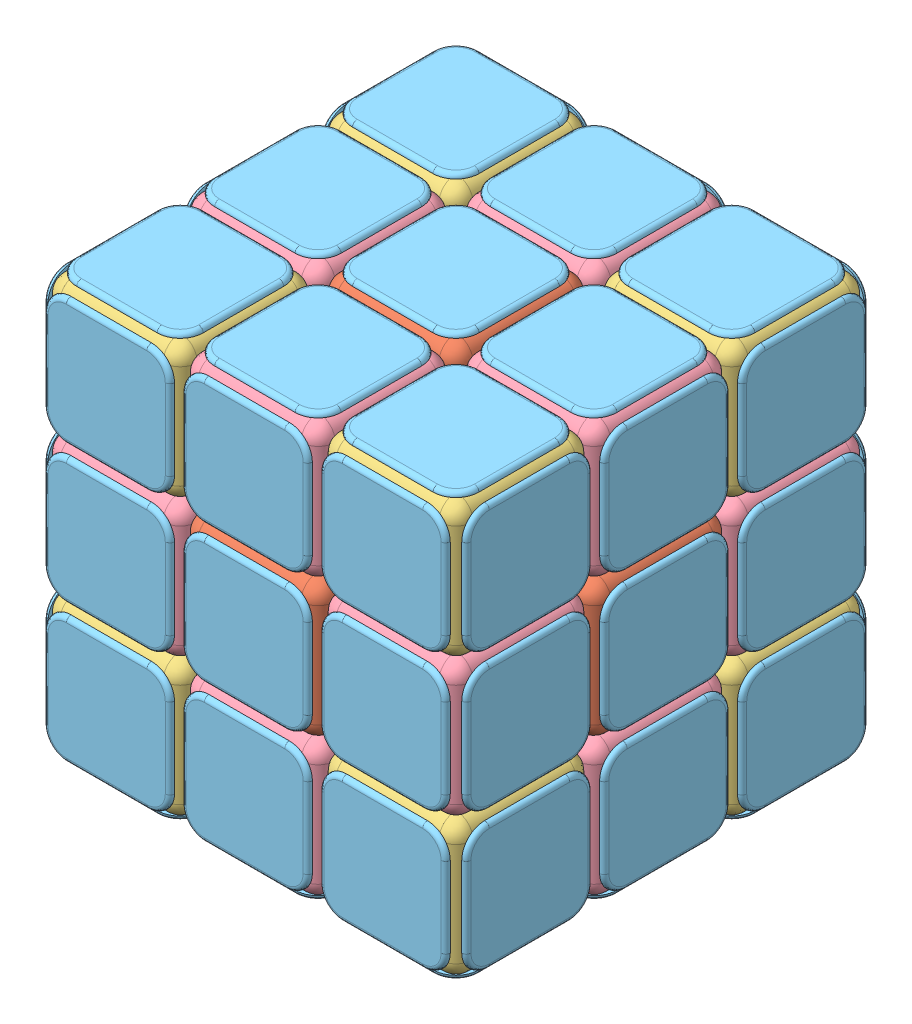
SolidWorks assembly Moving Rubik's Cube.SLDASM, configuration Default (file format 9000). Lengths in mm.
Overall size (92 92 92).
81 component instances, 5 part files, 325 mates.
Components (placement in the parent):
- Base-1: Base.SLDPRT [Default] at origin size (74.62 74.62 74.62)
- Centre Cap-1: Centre Cap.SLDPRT [Default] at (0 13.1631 0) x (1 0 0) z (0 -1 0) size (30 30 30)
- Corner-1: Corner.SLDPRT [Default] at (9.0013 9.0013 -9.1286) x (1 0 0) z (0 -1 0) size (37.5 37.5 37.5)
- Edge-1: Edge.SLDPRT [Default] at (0 9.823 -9.823) x (0 1 0) z (0 0 1) size (37.5 30 37.5)
- Corner-2: Corner.SLDPRT [Default] at (-9.1286 9.0013 -9.0014) x (0 0 -1) z (0 -1 0) size (37.5 37.5 37.5)
- Edge-2: Edge.SLDPRT [Default] at (-9.823 9.823 0) x (0 1 0) z (1 0 0) size (37.5 30 37.5)
- Corner-3: Corner.SLDPRT [Default] at (-9.0014 9.0013 9.1285) x (-1 0 0) z (0 -1 0) size (37.5 37.5 37.5)
- Edge-3: Edge.SLDPRT [Default] at (0 9.823 9.823) x (0 1 0) z (0 0 -1) size (37.5 30 37.5)
- Corner-4: Corner.SLDPRT [Default] at (9.1285 9.0013 9.0013) x (0 0 1) z (0 -1 0) size (37.5 37.5 37.5)
- Edge-4: Edge.SLDPRT [Default] at (9.823 9.823 0) x (0 1 0) z (-1 0 0) size (37.5 30 37.5)
- Edge-5: Edge.SLDPRT [Default] at (9.823 0 -9.823) x (0 0 -1) z (-1 0 0) size (37.5 30 37.5)
- Edge-6: Edge.SLDPRT [Default] at (-9.823 0 -9.823) x (-1 0 0) z (0 0 1) size (37.5 30 37.5)
- Edge-7: Edge.SLDPRT [Default] at (-9.823 0 9.823) x (0 0 1) z (1 0 0) size (37.5 30 37.5)
- Edge-8: Edge.SLDPRT [Default] at (9.823 0 9.823) x (1 0 0) z (0 0 -1) size (37.5 30 37.5)
- Centre Cap-2: Centre Cap.SLDPRT [Default] at (0 0 -13.1631) size (30 30 30)
- Centre Cap-3: Centre Cap.SLDPRT [Default] at (-13.1631 0 0) x (0 0 -1) z (1 0 0) size (30 30 30)
- Centre Cap-4: Centre Cap.SLDPRT [Default] at (0 0 13.1631) x (-1 0 0) z (0 0 -1) size (30 30 30)
- Centre Cap-5: Centre Cap.SLDPRT [Default] at (13.1631 0 0) x (0 0 1) z (-1 0 0) size (30 30 30)
- Corner-6: Corner.SLDPRT [Default] at (9.0013 -9.1286 -9.0014) size (37.5 37.5 37.5)
- Corner-7: Corner.SLDPRT [Default] at (-9.0014 -9.1286 -9.0014) x (0 0 -1) z (1 0 0) size (37.5 37.5 37.5)
- Corner-8: Corner.SLDPRT [Default] at (-9.0014 -9.1286 9.0013) x (-1 0 0) z (0 0 -1) size (37.5 37.5 37.5)
- Corner-9: Corner.SLDPRT [Default] at (9.0013 -9.1286 9.0013) x (0 0 1) z (-1 0 0) size (37.5 37.5 37.5)
- Edge-9: Edge.SLDPRT [Default] at (0 -9.823 -9.823) x (0 -1 0) z (0 0 1) size (37.5 30 37.5)
- Edge-10: Edge.SLDPRT [Default] at (-9.823 -9.823 0) x (0 -1 0) z (1 0 0) size (37.5 30 37.5)
- Edge-11: Edge.SLDPRT [Default] at (0 -9.823 9.823) x (0 -1 0) z (0 0 -1) size (37.5 30 37.5)
- Edge-12: Edge.SLDPRT [Default] at (9.823 -9.823 0) x (0 -1 0) z (-1 0 0) size (37.5 30 37.5)
- Centre Cap-6: Centre Cap.SLDPRT [Default] at (0 -13.1631 0) x (1 0 0) z (0 1 0) size (30 30 30)
- Sticker-1: Sticker.SLDPRT [Default] at (-30 30 45) size (27.5 27.5 1)
- Sticker-2: Sticker.SLDPRT [Default] at (0 30 45) size (27.5 27.5 1)
- Sticker-3: Sticker.SLDPRT [Default] at (30 30 45) size (27.5 27.5 1)
- Sticker-6: Sticker.SLDPRT [Default] at (-30 0 45) size (27.5 27.5 1)
- Sticker-7: Sticker.SLDPRT [Default] at (0 0 45) size (27.5 27.5 1)
- Sticker-8: Sticker.SLDPRT [Default] at (30 0 45) x (0 -1 0) z (0 0 1) size (27.5 27.5 1)
- Sticker-9: Sticker.SLDPRT [Default] at (-30 -30 45) size (27.5 27.5 1)
- Sticker-10: Sticker.SLDPRT [Default] at (0 -30 45) size (27.5 27.5 1)
- Sticker-11: Sticker.SLDPRT [Default] at (30 -30 45) size (27.5 27.5 1)
- Sticker-12: Sticker.SLDPRT [Default] at (45 30 30) x (0 0 -1) z (1 0 0) size (27.5 27.5 1)
- Sticker-13: Sticker.SLDPRT [Default] at (45 30 0) x (0 0 -1) z (1 0 0) size (27.5 27.5 1)
- Sticker-14: Sticker.SLDPRT [Default] at (45 30 -30) x (0 0 -1) z (1 0 0) size (27.5 27.5 1)
- Sticker-15: Sticker.SLDPRT [Default] at (45 0 30) x (0 0 -1) z (1 0 0) size (27.5 27.5 1)
- Sticker-16: Sticker.SLDPRT [Default] at (45 0 0) x (0 0 -1) z (1 0 0) size (27.5 27.5 1)
- Sticker-17: Sticker.SLDPRT [Default] at (45 0 -30) x (0 -1 0) z (1 0 0) size (27.5 27.5 1)
- Sticker-18: Sticker.SLDPRT [Default] at (45 -30 30) x (0 0 -1) z (1 0 0) size (27.5 27.5 1)
- Sticker-19: Sticker.SLDPRT [Default] at (45 -30 0) x (0 0 -1) z (1 0 0) size (27.5 27.5 1)
- Sticker-20: Sticker.SLDPRT [Default] at (45 -30 -30) x (0 0 -1) z (1 0 0) size (27.5 27.5 1)
- Sticker-21: Sticker.SLDPRT [Default] at (-30 45 -30) x (1 0 0) z (0 1 0) size (27.5 27.5 1)
- Sticker-22: Sticker.SLDPRT [Default] at (0 45 -30) x (1 0 0) z (0 1 0) size (27.5 27.5 1)
- Sticker-23: Sticker.SLDPRT [Default] at (30 45 -30) x (1 0 0) z (0 1 0) size (27.5 27.5 1)
- Sticker-24: Sticker.SLDPRT [Default] at (-30 45 0) x (1 0 0) z (0 1 0) size (27.5 27.5 1)
- Sticker-25: Sticker.SLDPRT [Default] at (0 45 0) x (1 0 0) z (0 1 0) size (27.5 27.5 1)
- Sticker-26: Sticker.SLDPRT [Default] at (30 45 0) x (1 0 0) z (0 1 0) size (27.5 27.5 1)
- Sticker-27: Sticker.SLDPRT [Default] at (-30 45 30) x (1 0 0) z (0 1 0) size (27.5 27.5 1)
- Sticker-28: Sticker.SLDPRT [Default] at (0 45 30) x (1 0 0) z (0 1 0) size (27.5 27.5 1)
- Sticker-29: Sticker.SLDPRT [Default] at (30 45 30) x (1 0 0) z (0 1 0) size (27.5 27.5 1)
- Sticker-30: Sticker.SLDPRT [Default] at (30 30 -45) x (-1 0 0) z (0 0 -1) size (27.5 27.5 1)
- Sticker-31: Sticker.SLDPRT [Default] at (0 30 -45) x (-1 0 0) z (0 0 -1) size (27.5 27.5 1)
- Sticker-32: Sticker.SLDPRT [Default] at (-30 30 -45) x (-1 0 0) z (0 0 -1) size (27.5 27.5 1)
- Sticker-33: Sticker.SLDPRT [Default] at (30 0 -45) x (-1 0 0) z (0 0 -1) size (27.5 27.5 1)
- Sticker-34: Sticker.SLDPRT [Default] at (0 0 -45) x (-1 0 0) z (0 0 -1) size (27.5 27.5 1)
- Sticker-35: Sticker.SLDPRT [Default] at (-30 0 -45) x (0 -1 0) z (0 0 -1) size (27.5 27.5 1)
- Sticker-36: Sticker.SLDPRT [Default] at (30 -30 -45) x (-1 0 0) z (0 0 -1) size (27.5 27.5 1)
- Sticker-37: Sticker.SLDPRT [Default] at (0 -30 -45) x (-1 0 0) z (0 0 -1) size (27.5 27.5 1)
- Sticker-38: Sticker.SLDPRT [Default] at (-30 -30 -45) x (-1 0 0) z (0 0 -1) size (27.5 27.5 1)
- Sticker-39: Sticker.SLDPRT [Default] at (-45 30 -30) x (0 0 1) z (-1 0 0) size (27.5 27.5 1)
- Sticker-40: Sticker.SLDPRT [Default] at (-45 30 0) x (0 0 1) z (-1 0 0) size (27.5 27.5 1)
- Sticker-41: Sticker.SLDPRT [Default] at (-45 30 30) x (0 0 1) z (-1 0 0) size (27.5 27.5 1)
- Sticker-42: Sticker.SLDPRT [Default] at (-45 0 -30) x (0 0 1) z (-1 0 0) size (27.5 27.5 1)
- Sticker-43: Sticker.SLDPRT [Default] at (-45 0 0) x (0 0 1) z (-1 0 0) size (27.5 27.5 1)
- Sticker-44: Sticker.SLDPRT [Default] at (-45 0 30) x (0 -1 0) z (-1 0 0) size (27.5 27.5 1)
- Sticker-45: Sticker.SLDPRT [Default] at (-45 -30 -30) x (0 0 1) z (-1 0 0) size (27.5 27.5 1)
- Sticker-46: Sticker.SLDPRT [Default] at (-45 -30 0) x (0 0 1) z (-1 0 0) size (27.5 27.5 1)
- Sticker-47: Sticker.SLDPRT [Default] at (-45 -30 30) x (0 0 1) z (-1 0 0) size (27.5 27.5 1)
- Sticker-48: Sticker.SLDPRT [Default] at (-30 -45 30) x (0 0 1) z (0 -1 0) size (27.5 27.5 1)
- Sticker-49: Sticker.SLDPRT [Default] at (0 -45 30) x (0 0 1) z (0 -1 0) size (27.5 27.5 1)
- Sticker-50: Sticker.SLDPRT [Default] at (30 -45 30) x (0 0 1) z (0 -1 0) size (27.5 27.5 1)
- Sticker-51: Sticker.SLDPRT [Default] at (-30 -45 0) x (0 0 1) z (0 -1 0) size (27.5 27.5 1)
- Sticker-52: Sticker.SLDPRT [Default] at (0 -45 0) x (0 0 1) z (0 -1 0) size (27.5 27.5 1)
- Sticker-53: Sticker.SLDPRT [Default] at (30 -45 0) x (0 0 1) z (0 -1 0) size (27.5 27.5 1)
- Sticker-54: Sticker.SLDPRT [Default] at (-30 -45 -30) x (0 0 1) z (0 -1 0) size (27.5 27.5 1)
- Sticker-55: Sticker.SLDPRT [Default] at (0 -45 -30) x (0 0 1) z (0 -1 0) size (27.5 27.5 1)
- Sticker-56: Sticker.SLDPRT [Default] at (30 -45 -30) x (0 0 1) z (0 -1 0) size (27.5 27.5 1)
Mates (geometry in assembly coordinates):
- Coincident1: coordinate: point of Base-1; point of assembly
- Tangent1: tangent aligned: sphere of Base-1; sphere of Centre Cap-1
- Tangent3: tangent aligned: sphere of Centre Cap-1; sphere of Corner-1
- Tangent4: tangent aligned: sphere of Centre Cap-1; sphere of Edge-1
- Tangent5: tangent aligned: sphere of Centre Cap-1; sphere of Corner-2
- Tangent6: tangent aligned: sphere of Centre Cap-1; sphere of Edge-2
- Tangent7: tangent aligned: sphere of Centre Cap-1; sphere of Corner-3
- Tangent8: tangent aligned: sphere of Centre Cap-1; sphere of Edge-3
- Tangent9: tangent aligned: sphere of Centre Cap-1; sphere of Corner-4
- Tangent10: tangent aligned: sphere of Centre Cap-1; sphere of Edge-4
- Bottom Coincident: concentric anti-aligned: cylinder of Base-1 through (0 37.5 0) axis (0 -1 0) radius 3.75; cylinder of Centre Cap-1 through (0 -375000 0) axis (0 1 0) radius 3.75
- Coincident2: coincident aligned: plane of Centre Cap-1 through (0 -45 0) normal (0 -1 0); plane of Corner-1 through (0 -45 0) normal (0 -1 0)
- Coincident4: coincident aligned: plane of Centre Cap-1 through (0 -45 0) normal (0 -1 0); plane of Edge-1 through (45 -45 45) normal (0 -1 0)
- Coincident6: coincident aligned: plane of Centre Cap-1 through (0 -45 0) normal (0 -1 0); plane of Corner-2 through (0 -45 0) normal (0 -1 0)
- Coincident8: coincident aligned: plane of Centre Cap-1 through (0 -45 0) normal (0 -1 0); plane of Edge-2 through (45 -45 -45) normal (0 -1 0)
- Coincident10: coincident aligned: plane of Centre Cap-1 through (0 -45 0) normal (0 -1 0); plane of Corner-3 through (0 -45 0) normal (0 -1 0)
- Coincident12: coincident aligned: plane of Centre Cap-1 through (0 -45 0) normal (0 -1 0); plane of Edge-3 through (-45 -45 -45) normal (0 -1 0)
- Coincident14: coincident aligned: plane of Centre Cap-1 through (0 -45 0) normal (0 -1 0); plane of Corner-4 through (0 -45 0) normal (0 -1 0)
- Coincident16: coincident aligned: plane of Centre Cap-1 through (0 -45 0) normal (0 -1 0); plane of Edge-4 through (-45 -45 45) normal (0 -1 0)
- X: coincident anti-aligned: plane of Centre Cap-1 through (-15 45 0) normal (-1 0 0); plane of Corner-1 through (-15 45 0) normal (1 0 0)
- XX: coincident aligned: plane of Centre Cap-1 through (15 45 0) normal (1 0 0); plane of Edge-1 through (15 0 -45) normal (1 0 0)
- XXX: coincident anti-aligned: plane of Centre Cap-1 through (15 45 0) normal (1 0 0); plane of Corner-2 through (15 45 0) normal (-1 0 0)
- XXXX: coincident aligned: plane of Centre Cap-1 through (0 45 -15) normal (0 0 -1); plane of Edge-2 through (-45 0 -15) normal (0 0 -1)
- XXXXX: coincident anti-aligned: plane of Centre Cap-1 through (15 45 0) normal (1 0 0); plane of Corner-3 through (15 45 0) normal (-1 0 0)
- XXXXXX: coincident aligned: plane of Centre Cap-1 through (-15 45 0) normal (-1 0 0); plane of Edge-3 through (-15 0 45) normal (-1 0 0)
- XXXXXXX: coincident anti-aligned: plane of Centre Cap-1 through (0 45 -15) normal (0 0 -1); plane of Corner-4 through (0 45 -15) normal (0 0 1)
- XXXXXXXX: coincident aligned: plane of Centre Cap-1 through (0 45 15) normal (0 0 1); plane of Edge-4 through (45 0 15) normal (0 0 1)
- Coincident118: coincident anti-aligned: plane of Centre Cap-1 through (0 45 15) normal (0 0 1); plane of Edge-1 through (15 0 15) normal (0 0 -1)
- Coincident19: coincident aligned: plane of Corner-1 through (45 -45 45) normal (0 0 1); plane of Edge-5 through (-45 45 45) normal (0 0 1)
- Coincident20: coincident aligned: plane of Corner-1 through (-45 -45 -45) normal (-1 0 0); plane of Edge-5 through (-45 0 0) normal (-1 0 0)
- Coincident22: coincident aligned: plane of Corner-2 through (-45 -45 45) normal (0 0 1); plane of Edge-6 through (0 0 45) normal (0 0 1)
- Coincident23: coincident aligned: plane of Corner-2 through (45 -45 -45) normal (1 0 0); plane of Edge-6 through (45 45 45) normal (1 0 0)
- Coincident25: coincident aligned: plane of Corner-3 through (45 -45 45) normal (1 0 0); plane of Edge-7 through (45 0 0) normal (1 0 0)
- Coincident26: coincident aligned: plane of Edge-3 through (0 0 -45) normal (0 0 -1); plane of Edge-7 through (45 45 -45) normal (0 0 -1)
- Coincident28: coincident aligned: plane of Corner-4 through (-45 -45 45) normal (-1 0 0); plane of Edge-8 through (-45 45 -45) normal (-1 0 0)
- Coincident29: coincident aligned: plane of Corner-4 through (45 -45 -45) normal (0 0 -1); plane of Edge-8 through (0 0 -45) normal (0 0 -1)
- Top Concentric: concentric aligned: cylinder of Base-1 through (0 37.5 0) axis (0 -1 0) radius 3.75; cylinder of Centre Cap-6 through (0 375000 0) axis (0 -1 0) radius 3.75
- Coincident119: coincident aligned: plane of Corner-9 through (-45 45 45) normal (0 1 0); plane of Edge-12 through (-45 45 -45) normal (0 1 0)
- Coincident121: coincident aligned: plane of Corner-9 through (-45 45 45) normal (0 1 0); plane of Corner-6 through (45 45 45) normal (0 1 0)
- Coincident122: coincident aligned: plane of Corner-9 through (-45 45 45) normal (0 1 0); plane of Edge-11 through (45 45 -45) normal (0 1 0)
- Coincident123: coincident aligned: plane of Corner-9 through (-45 45 45) normal (0 1 0); plane of Centre Cap-6 through (0 45 0) normal (0 1 0)
- Coincident124: coincident aligned: plane of Corner-9 through (-45 45 45) normal (0 1 0); plane of Edge-9 through (-45 45 45) normal (0 1 0)
- Coincident125: coincident aligned: plane of Corner-9 through (-45 45 45) normal (0 1 0); plane of Corner-8 through (-45 45 -45) normal (0 1 0)
- Coincident126: coincident aligned: plane of Corner-9 through (-45 45 45) normal (0 1 0); plane of Edge-10 through (45 45 45) normal (0 1 0)
- Coincident127: coincident aligned: plane of Corner-9 through (-45 45 45) normal (0 1 0); plane of Corner-7 through (45 45 -45) normal (0 1 0)
- Coincident128: coincident anti-aligned: plane of Edge-9 through (-15 0 15) normal (0 0 -1); plane of Centre Cap-6 through (0 -45 15) normal (0 0 1)
- Coincident137: coincident anti-aligned: plane of Corner-6 through (-15 0 -45) normal (1 0 0); plane of Centre Cap-6 through (-15 -45 0) normal (-1 0 0)
- Coincident138: coincident aligned: plane of Edge-9 through (-15 0 -45) normal (-1 0 0); plane of Centre Cap-6 through (-15 -45 0) normal (-1 0 0)
- Coincident139: coincident anti-aligned: plane of Corner-7 through (15 15 0) normal (-1 0 0); plane of Centre Cap-6 through (15 -45 0) normal (1 0 0)
- Coincident140: coincident aligned: plane of Edge-10 through (-45 0 15) normal (0 0 1); plane of Centre Cap-6 through (0 -45 15) normal (0 0 1)
- Coincident141: coincident anti-aligned: plane of Corner-8 through (0 15 -15) normal (0 0 1); plane of Centre Cap-6 through (0 -45 -15) normal (0 0 -1)
- Coincident143: coincident aligned: plane of Edge-11 through (15 0 45) normal (1 0 0); plane of Centre Cap-6 through (15 -45 0) normal (1 0 0)
- Coincident144: coincident anti-aligned: plane of Corner-9 through (-15 15 0) normal (1 0 0); plane of Centre Cap-6 through (-15 -45 0) normal (-1 0 0)
- Coincident145: coincident aligned: plane of Edge-12 through (45 0 -15) normal (0 0 -1); plane of Centre Cap-6 through (0 -45 -15) normal (0 0 -1)
- Coincident30: coincident aligned: plane of Edge-5 through (-45 45 45) normal (0 0 1); plane of Corner-6 through (0 0 45) normal (0 0 1)
- Coincident31: coincident aligned: plane of Edge-5 through (-45 0 0) normal (-1 0 0); plane of Corner-6 through (-45 -45 45) normal (-1 0 0)
- Coincident32: coincident aligned: plane of Edge-6 through (0 0 45) normal (0 0 1); plane of Corner-7 through (45 -45 45) normal (0 0 1)
- Coincident33: coincident aligned: plane of Edge-6 through (45 45 45) normal (1 0 0); plane of Corner-7 through (45 0 0) normal (1 0 0)
- Coincident34: coincident aligned: plane of Edge-7 through (45 45 -45) normal (0 0 -1); plane of Corner-8 through (0 0 -45) normal (0 0 -1)
- Coincident35: coincident aligned: plane of Edge-7 through (45 0 0) normal (1 0 0); plane of Corner-8 through (45 -45 -45) normal (1 0 0)
- Coincident36: coincident aligned: plane of Edge-8 through (0 0 -45) normal (0 0 -1); plane of Corner-9 through (-45 -45 -45) normal (0 0 -1)
- Coincident37: coincident aligned: plane of Edge-8 through (-45 45 -45) normal (-1 0 0); plane of Corner-9 through (-45 0 0) normal (-1 0 0)
- Coincident38: coincident aligned: plane of Centre Cap-2 through (0 0 45) normal (0 0 1); plane of Edge-9 through (0 0 45) normal (0 0 1)
- Coincident40: coincident aligned: plane of Centre Cap-3 through (45 0 0) normal (1 0 0); plane of Edge-10 through (45 0 0) normal (1 0 0)
- Coincident42: coincident aligned: plane of Centre Cap-4 through (0 0 -45) normal (0 0 -1); plane of Edge-11 through (0 0 -45) normal (0 0 -1)
- Coincident44: coincident aligned: plane of Centre Cap-5 through (-45 0 0) normal (-1 0 0); plane of Edge-12 through (-45 0 0) normal (-1 0 0)
- Front Concentric: concentric aligned: cylinder of Base-1 through (0 0 37.5) axis (0 0 -1) radius 3.75; cylinder of Centre Cap-2 through (0 0 375000) axis (0 0 -1) radius 3.75
- Coincident146: coincident aligned: plane of Corner-6 through (0 0 45) normal (0 0 1); plane of Edge-9 through (0 0 45) normal (0 0 1)
- Coincident147: coincident aligned: plane of Corner-6 through (0 0 45) normal (0 0 1); plane of Corner-7 through (45 -45 45) normal (0 0 1)
- Coincident148: coincident aligned: plane of Corner-6 through (0 0 45) normal (0 0 1); plane of Edge-6 through (0 0 45) normal (0 0 1)
- Coincident149: coincident aligned: plane of Corner-6 through (0 0 45) normal (0 0 1); plane of Centre Cap-2 through (0 0 45) normal (0 0 1)
- Coincident150: coincident aligned: plane of Corner-6 through (0 0 45) normal (0 0 1); plane of Edge-5 through (-45 45 45) normal (0 0 1)
- Coincident151: coincident aligned: plane of Corner-6 through (0 0 45) normal (0 0 1); plane of Corner-1 through (45 -45 45) normal (0 0 1)
- Coincident152: coincident aligned: plane of Corner-6 through (0 0 45) normal (0 0 1); plane of Edge-1 through (0 0 45) normal (0 0 1)
- Coincident153: coincident aligned: plane of Corner-6 through (0 0 45) normal (0 0 1); plane of Corner-2 through (-45 -45 45) normal (0 0 1)
- Coincident154: coincident anti-aligned: plane of Centre Cap-2 through (0 15 -45) normal (0 1 0); plane of Edge-9 through (0 15 -45) normal (0 -1 0)
- Coincident155: coincident anti-aligned: plane of Centre Cap-2 through (-15 0 -45) normal (-1 0 0); plane of Corner-6 through (-15 0 -45) normal (1 0 0)
- Coincident156: coincident aligned: plane of Centre Cap-2 through (-15 0 -45) normal (-1 0 0); plane of Edge-9 through (-15 0 -45) normal (-1 0 0)
- Coincident157: coincident anti-aligned: plane of Centre Cap-2 through (15 0 -45) normal (1 0 0); plane of Corner-7 through (15 15 0) normal (-1 0 0)
- Coincident158: coincident aligned: plane of Edge-6 through (0 15 -45) normal (0 1 0); plane of Centre Cap-2 through (0 15 -45) normal (0 1 0)
- Coincident161: coincident anti-aligned: plane of Corner-2 through (15 -15 0) normal (0 1 0); plane of Centre Cap-2 through (0 -15 -45) normal (0 -1 0)
- Coincident159: coincident aligned: plane of Edge-1 through (15 0 -45) normal (1 0 0); plane of Centre Cap-2 through (15 0 -45) normal (1 0 0)
- Coincident160: coincident aligned: plane of Edge-1 through (-15 0 -45) normal (-1 0 0); plane of Centre Cap-2 through (-15 0 -45) normal (-1 0 0)
- Coincident162: coincident aligned: plane of Edge-5 through (45 -15 0) normal (0 -1 0); plane of Centre Cap-2 through (0 -15 -45) normal (0 -1 0)
- Coincident163: coincident aligned: plane of Edge-5 through (45 15 0) normal (0 1 0); plane of Centre Cap-2 through (0 15 -45) normal (0 1 0)
- Back Concentric: concentric anti-aligned: cylinder of Base-1 through (0 0 37.5) axis (0 0 -1) radius 3.75; cylinder of Centre Cap-4 through (0 0 -375000) axis (0 0 1) radius 3.75
- Coincident164: coincident aligned: plane of Corner-9 through (-45 -45 -45) normal (0 0 -1); plane of Edge-11 through (0 0 -45) normal (0 0 -1)
- Coincident165: coincident aligned: plane of Corner-9 through (-45 -45 -45) normal (0 0 -1); plane of Corner-8 through (0 0 -45) normal (0 0 -1)
- Coincident166: coincident aligned: plane of Corner-9 through (-45 -45 -45) normal (0 0 -1); plane of Edge-7 through (45 45 -45) normal (0 0 -1)
- Coincident167: coincident aligned: plane of Corner-9 through (-45 -45 -45) normal (0 0 -1); plane of Centre Cap-4 through (0 0 -45) normal (0 0 -1)
- Coincident168: coincident aligned: plane of Corner-9 through (-45 -45 -45) normal (0 0 -1); plane of Edge-8 through (0 0 -45) normal (0 0 -1)
- Coincident169: coincident aligned: plane of Corner-9 through (-45 -45 -45) normal (0 0 -1); plane of Corner-4 through (45 -45 -45) normal (0 0 -1)
- Coincident170: coincident aligned: plane of Corner-9 through (-45 -45 -45) normal (0 0 -1); plane of Edge-3 through (0 0 -45) normal (0 0 -1)
- Coincident171: coincident aligned: plane of Corner-9 through (-45 -45 -45) normal (0 0 -1); plane of Corner-3 through (-45 -45 -45) normal (0 0 -1)
- Coincident172: coincident anti-aligned: plane of Centre Cap-4 through (15 0 45) normal (1 0 0); plane of Corner-8 through (15 0 45) normal (-1 0 0)
- Coincident173: coincident aligned: plane of Centre Cap-4 through (15 0 45) normal (1 0 0); plane of Edge-11 through (15 0 45) normal (1 0 0)
- Coincident174: coincident anti-aligned: plane of Centre Cap-4 through (-15 0 45) normal (-1 0 0); plane of Corner-9 through (-15 15 0) normal (1 0 0)
- Coincident175: coincident aligned: plane of Edge-8 through (0 15 45) normal (0 1 0); plane of Centre Cap-4 through (0 15 45) normal (0 1 0)
- Coincident176: coincident anti-aligned: plane of Corner-4 through (-15 -15 0) normal (0 1 0); plane of Centre Cap-4 through (0 -15 45) normal (0 -1 0)
- Coincident182: coincident aligned: plane of Edge-3 through (-15 0 45) normal (-1 0 0); plane of Centre Cap-4 through (-15 0 45) normal (-1 0 0)
- Coincident178: coincident anti-aligned: plane of Corner-3 through (15 45 0) normal (-1 0 0); plane of Centre Cap-4 through (15 0 45) normal (1 0 0)
- Coincident179: coincident aligned: plane of Edge-7 through (-45 -15 0) normal (0 -1 0); plane of Centre Cap-4 through (0 -15 45) normal (0 -1 0)
- Coincident180: coincident aligned: plane of Edge-7 through (-45 15 0) normal (0 1 0); plane of Centre Cap-4 through (0 15 45) normal (0 1 0)
- Coincident181: coincident anti-aligned: plane of Centre Cap-4 through (0 15 45) normal (0 1 0); plane of Edge-11 through (0 15 45) normal (0 -1 0)
- Left Concentric: concentric aligned: cylinder of Base-1 through (37.5 0 0) axis (-1 0 0) radius 3.75; cylinder of Centre Cap-3 through (375000 0 0) axis (-1 0 0) radius 3.75
- Coincident191: coincident aligned: plane of Corner-7 through (45 0 0) normal (1 0 0); plane of Edge-10 through (45 0 0) normal (1 0 0)
- Coincident192: coincident aligned: plane of Corner-7 through (45 0 0) normal (1 0 0); plane of Corner-8 through (45 -45 -45) normal (1 0 0)
- Coincident193: coincident aligned: plane of Corner-7 through (45 0 0) normal (1 0 0); plane of Edge-6 through (45 45 45) normal (1 0 0)
- Coincident194: coincident aligned: plane of Corner-7 through (45 0 0) normal (1 0 0); plane of Centre Cap-3 through (45 0 0) normal (1 0 0)
- Coincident195: coincident aligned: plane of Corner-7 through (45 0 0) normal (1 0 0); plane of Edge-7 through (45 0 0) normal (1 0 0)
- Coincident196: coincident aligned: plane of Corner-7 through (45 0 0) normal (1 0 0); plane of Corner-2 through (45 -45 -45) normal (1 0 0)
- Coincident197: coincident aligned: plane of Corner-7 through (45 0 0) normal (1 0 0); plane of Edge-2 through (45 0 0) normal (1 0 0)
- Coincident198: coincident aligned: plane of Corner-7 through (45 0 0) normal (1 0 0); plane of Corner-3 through (45 -45 45) normal (1 0 0)
- Coincident200: coincident anti-aligned: plane of Centre Cap-3 through (-45 0 15) normal (0 0 1); plane of Corner-7 through (-45 0 15) normal (0 0 -1)
- Coincident201: coincident aligned: plane of Centre Cap-3 through (-45 0 15) normal (0 0 1); plane of Edge-10 through (-45 0 15) normal (0 0 1)
- Coincident202: coincident anti-aligned: plane of Centre Cap-3 through (-45 0 -15) normal (0 0 -1); plane of Corner-8 through (0 15 -15) normal (0 0 1)
- Coincident203: coincident aligned: plane of Edge-7 through (-45 15 0) normal (0 1 0); plane of Centre Cap-3 through (-45 15 0) normal (0 1 0)
- Coincident209: coincident aligned: plane of Edge-7 through (-45 -15 0) normal (0 -1 0); plane of Centre Cap-3 through (-45 -15 0) normal (0 -1 0)
- Coincident204: coincident anti-aligned: plane of Corner-3 through (0 45 -15) normal (0 0 1); plane of Centre Cap-3 through (-45 0 -15) normal (0 0 -1)
- Coincident205: coincident aligned: plane of Edge-2 through (-45 0 15) normal (0 0 1); plane of Centre Cap-3 through (-45 0 15) normal (0 0 1)
- Coincident206: coincident anti-aligned: plane of Corner-2 through (15 -15 0) normal (0 1 0); plane of Centre Cap-3 through (-45 -15 0) normal (0 -1 0)
- Coincident207: coincident aligned: plane of Edge-6 through (0 15 -45) normal (0 1 0); plane of Centre Cap-3 through (-45 15 0) normal (0 1 0)
- Coincident208: coincident anti-aligned: plane of Centre Cap-3 through (-45 15 0) normal (0 1 0); plane of Edge-10 through (-45 15 0) normal (0 -1 0)
- Right Concentric: concentric anti-aligned: cylinder of Base-1 through (37.5 0 0) axis (-1 0 0) radius 3.75; cylinder of Centre Cap-5 through (-375000 0 0) axis (1 0 0) radius 3.75
- Coincident210: coincident aligned: plane of Corner-9 through (-45 0 0) normal (-1 0 0); plane of Edge-12 through (-45 0 0) normal (-1 0 0)
- Coincident211: coincident aligned: plane of Corner-9 through (-45 0 0) normal (-1 0 0); plane of Corner-6 through (-45 -45 45) normal (-1 0 0)
- Coincident213: coincident aligned: plane of Corner-9 through (-45 0 0) normal (-1 0 0); plane of Edge-8 through (-45 45 -45) normal (-1 0 0)
- Coincident214: coincident aligned: plane of Corner-9 through (-45 0 0) normal (-1 0 0); plane of Centre Cap-5 through (-45 0 0) normal (-1 0 0)
- Coincident215: coincident aligned: plane of Corner-9 through (-45 0 0) normal (-1 0 0); plane of Edge-5 through (-45 0 0) normal (-1 0 0)
- Coincident216: coincident aligned: plane of Corner-9 through (-45 0 0) normal (-1 0 0); plane of Corner-4 through (-45 -45 45) normal (-1 0 0)
- Coincident217: coincident aligned: plane of Corner-9 through (-45 0 0) normal (-1 0 0); plane of Edge-4 through (-45 0 0) normal (-1 0 0)
- Coincident218: coincident aligned: plane of Corner-9 through (-45 0 0) normal (-1 0 0); plane of Corner-1 through (-45 -45 -45) normal (-1 0 0)
- Coincident219: coincident anti-aligned: plane of Centre Cap-5 through (45 0 -15) normal (0 0 -1); plane of Corner-9 through (45 0 -15) normal (0 0 1)
- Coincident220: coincident aligned: plane of Centre Cap-5 through (45 0 -15) normal (0 0 -1); plane of Edge-12 through (45 0 -15) normal (0 0 -1)
- Coincident221: coincident anti-aligned: plane of Centre Cap-5 through (45 0 15) normal (0 0 1); plane of Corner-6 through (0 15 15) normal (0 0 -1)
- Coincident222: coincident aligned: plane of Edge-5 through (45 15 0) normal (0 1 0); plane of Centre Cap-5 through (45 15 0) normal (0 1 0)
- Coincident223: coincident anti-aligned: plane of Corner-1 through (0 -15 15) normal (0 1 0); plane of Centre Cap-5 through (45 -15 0) normal (0 -1 0)
- Coincident224: coincident aligned: plane of Edge-4 through (45 0 15) normal (0 0 1); plane of Centre Cap-5 through (45 0 15) normal (0 0 1)
- Coincident228: coincident aligned: plane of Edge-4 through (45 0 -15) normal (0 0 -1); plane of Centre Cap-5 through (45 0 -15) normal (0 0 -1)
- Coincident225: coincident anti-aligned: plane of Corner-4 through (-15 -15 0) normal (0 1 0); plane of Centre Cap-5 through (45 -15 0) normal (0 -1 0)
- Coincident226: coincident aligned: plane of Edge-8 through (0 15 45) normal (0 1 0); plane of Centre Cap-5 through (45 15 0) normal (0 1 0)
- Coincident227: coincident anti-aligned: plane of Centre Cap-5 through (45 15 0) normal (0 1 0); plane of Edge-12 through (45 15 0) normal (0 -1 0)
- Coincident18: coincident anti-aligned: plane of Corner-1 through (-36.7424 -7.5 -37.5) normal (0 1 0); plane of Edge-5 through (-35.9688 -7.5 55.2609) normal (0 -1 0)
- Coincident21: coincident anti-aligned: plane of Corner-2 through (-37.5 -7.5 36.7423) normal (0 1 0); plane of Edge-6 through (55.2609 -7.5 35.9687) normal (0 -1 0)
- Coincident24: coincident anti-aligned: plane of Corner-3 through (36.7423 -7.5 37.5) normal (0 1 0); plane of Edge-7 through (35.9687 -7.5 -55.2609) normal (0 -1 0)
- Coincident27: coincident anti-aligned: plane of Corner-4 through (37.5 -7.5 -36.7424) normal (0 1 0); plane of Edge-8 through (-55.2609 -7.5 -35.9688) normal (0 -1 0)
- Tangent11: tangent aligned: sphere of Base-1; sphere of Centre Cap-2
- Tangent12: tangent aligned: sphere of Base-1; sphere of Centre Cap-3
- Tangent13: tangent aligned: sphere of Base-1; sphere of Centre Cap-4
- Tangent14: tangent aligned: sphere of Base-1; sphere of Centre Cap-5
- Tangent15: tangent aligned: sphere of Edge-5; sphere of Corner-6
- Tangent16: tangent aligned: sphere of Edge-6; sphere of Corner-7
- Tangent17: tangent aligned: sphere of Edge-7; sphere of Corner-8
- Tangent18: tangent aligned: sphere of Edge-8; sphere of Corner-9
- Tangent19: tangent aligned: sphere of Centre Cap-2; sphere of Edge-9
- Coincident39: coincident anti-aligned: plane of Corner-7 through (7.5 -37.5 36.7423) normal (-1 0 0); plane of Edge-9 through (7.5 55.2609 35.9687) normal (1 0 0)
- Tangent20: tangent aligned: sphere of Centre Cap-3; sphere of Edge-10
- Coincident41: coincident anti-aligned: plane of Corner-8 through (36.7423 -37.5 -7.5) normal (0 0 1); plane of Edge-10 through (35.9687 55.2609 -7.5) normal (0 0 -1)
- Tangent21: tangent aligned: sphere of Centre Cap-4; sphere of Edge-11
- Coincident43: coincident anti-aligned: plane of Corner-9 through (-7.5 -37.5 -36.7424) normal (1 0 0); plane of Edge-11 through (-7.5 55.2609 -35.9688) normal (-1 0 0)
- Tangent22: tangent aligned: sphere of Centre Cap-5; sphere of Edge-12
- Coincident45: coincident anti-aligned: plane of Corner-6 through (-36.7424 -37.5 7.5) normal (0 0 -1); plane of Edge-12 through (-35.9688 55.2609 7.5) normal (0 0 1)
- Tangent23: tangent aligned: sphere of Base-1; sphere of Centre Cap-6
- Coincident46: coincident anti-aligned: plane of Corner-6 through (0 0 45) normal (0 0 1); plane of Sticker-1 through (-38.75 21.25 45) normal (0 0 -1)
- Coincident47: coincident anti-aligned: plane of Sticker-2 through (-8.75 21.25 45) normal (0 0 -1); plane of Edge-9 through (0 0 45) normal (0 0 1)
- Coincident48: coincident anti-aligned: plane of Corner-7 through (45 -45 45) normal (0 0 1); plane of Sticker-3 through (21.25 21.25 45) normal (0 0 -1)
- Coincident51: coincident anti-aligned: plane of Edge-5 through (-45 45 45) normal (0 0 1); plane of Sticker-6 through (-38.75 -8.75 45) normal (0 0 -1)
- Coincident53: coincident anti-aligned: plane of Centre Cap-2 through (0 0 45) normal (0 0 1); plane of Sticker-7 through (-8.75 -8.75 45) normal (0 0 -1)
- Coincident55: coincident anti-aligned: plane of Edge-6 through (0 0 45) normal (0 0 1); plane of Sticker-8 through (21.25 8.75 45) normal (0 0 -1)
- Coincident57: coincident anti-aligned: plane of Corner-1 through (45 -45 45) normal (0 0 1); plane of Sticker-9 through (-38.75 -38.75 45) normal (0 0 -1)
- Coincident58: coincident anti-aligned: plane of Edge-1 through (0 0 45) normal (0 0 1); plane of Sticker-10 through (-8.75 -38.75 45) normal (0 0 -1)
- Coincident61: coincident anti-aligned: plane of Corner-2 through (-45 -45 45) normal (0 0 1); plane of Sticker-11 through (21.25 -38.75 45) normal (0 0 -1)
- Coincident62: coincident anti-aligned: plane of Corner-7 through (45 0 0) normal (1 0 0); plane of Sticker-12 through (45 21.25 38.75) normal (-1 0 0)
- Coincident63: coincident anti-aligned: plane of Edge-10 through (45 0 0) normal (1 0 0); plane of Sticker-13 through (45 21.25 8.75) normal (-1 0 0)
- Coincident65: coincident anti-aligned: plane of Corner-8 through (45 -45 -45) normal (1 0 0); plane of Sticker-14 through (45 21.25 -21.25) normal (-1 0 0)
- Coincident66: coincident anti-aligned: plane of Edge-6 through (45 45 45) normal (1 0 0); plane of Sticker-15 through (45 -8.75 38.75) normal (-1 0 0)
- Coincident68: coincident anti-aligned: plane of Centre Cap-3 through (45 0 0) normal (1 0 0); plane of Sticker-16 through (45 -8.75 8.75) normal (-1 0 0)
- Coincident69: coincident anti-aligned: plane of Edge-7 through (45 0 0) normal (1 0 0); plane of Sticker-17 through (45 8.75 -21.25) normal (-1 0 0)
- Coincident71: coincident anti-aligned: plane of Corner-2 through (45 -45 -45) normal (1 0 0); plane of Sticker-18 through (45 -38.75 38.75) normal (-1 0 0)
- Coincident72: coincident anti-aligned: plane of Edge-2 through (45 0 0) normal (1 0 0); plane of Sticker-19 through (45 -38.75 8.75) normal (-1 0 0)
- Coincident73: coincident anti-aligned: plane of Corner-3 through (45 -45 45) normal (1 0 0); plane of Sticker-20 through (45 -38.75 -21.25) normal (-1 0 0)
- Coincident74: coincident anti-aligned: plane of Corner-9 through (-45 45 45) normal (0 1 0); plane of Sticker-21 through (-38.75 45 -21.25) normal (0 -1 0)
- Coincident75: coincident anti-aligned: plane of Edge-11 through (45 45 -45) normal (0 1 0); plane of Sticker-22 through (-8.75 45 -21.25) normal (0 -1 0)
- Coincident76: coincident anti-aligned: plane of Corner-8 through (-45 45 -45) normal (0 1 0); plane of Sticker-23 through (21.25 45 -21.25) normal (0 -1 0)
- Coincident77: coincident anti-aligned: plane of Edge-12 through (-45 45 -45) normal (0 1 0); plane of Sticker-24 through (-38.75 45 8.75) normal (0 -1 0)
- Coincident79: coincident anti-aligned: plane of Centre Cap-6 through (0 45 0) normal (0 1 0); plane of Sticker-25 through (-8.75 45 8.75) normal (0 -1 0)
- Coincident80: coincident anti-aligned: plane of Edge-10 through (45 45 45) normal (0 1 0); plane of Sticker-26 through (21.25 45 8.75) normal (0 -1 0)
- Coincident82: coincident anti-aligned: plane of Corner-6 through (45 45 45) normal (0 1 0); plane of Sticker-27 through (-38.75 45 38.75) normal (0 -1 0)
- Coincident83: coincident anti-aligned: plane of Edge-9 through (-45 45 45) normal (0 1 0); plane of Sticker-28 through (-8.75 45 38.75) normal (0 -1 0)
- Coincident229: coincident anti-aligned: plane of Corner-7 through (45 45 -45) normal (0 1 0); plane of Sticker-29 through (21.25 45 38.75) normal (0 -1 0)
- Coincident84: coincident anti-aligned: plane of Corner-8 through (0 0 -45) normal (0 0 -1); plane of Sticker-30 through (38.75 21.25 -45) normal (0 0 1)
- Coincident85: coincident anti-aligned: plane of Edge-11 through (0 0 -45) normal (0 0 -1); plane of Sticker-31 through (8.75 21.25 -45) normal (0 0 1)
- Coincident86: coincident anti-aligned: plane of Corner-9 through (-45 -45 -45) normal (0 0 -1); plane of Sticker-32 through (-21.25 21.25 -45) normal (0 0 1)
- Coincident87: coincident anti-aligned: plane of Edge-7 through (45 45 -45) normal (0 0 -1); plane of Sticker-33 through (38.75 -8.75 -45) normal (0 0 1)
- Coincident89: coincident anti-aligned: plane of Centre Cap-4 through (0 0 -45) normal (0 0 -1); plane of Sticker-34 through (8.75 -8.75 -45) normal (0 0 1)
- Coincident90: coincident anti-aligned: plane of Edge-8 through (0 0 -45) normal (0 0 -1); plane of Sticker-35 through (-21.25 8.75 -45) normal (0 0 1)
- Coincident91: coincident anti-aligned: plane of Corner-3 through (-45 -45 -45) normal (0 0 -1); plane of Sticker-36 through (38.75 -38.75 -45) normal (0 0 1)
- Coincident92: coincident anti-aligned: plane of Edge-3 through (0 0 -45) normal (0 0 -1); plane of Sticker-37 through (8.75 -38.75 -45) normal (0 0 1)
- Coincident93: coincident anti-aligned: plane of Corner-4 through (45 -45 -45) normal (0 0 -1); plane of Sticker-38 through (-21.25 -38.75 -45) normal (0 0 1)
- Coincident94: coincident anti-aligned: plane of Corner-9 through (-45 0 0) normal (-1 0 0); plane of Sticker-39 through (-45 21.25 -38.75) normal (1 0 0)
- Coincident95: coincident anti-aligned: plane of Edge-12 through (-45 0 0) normal (-1 0 0); plane of Sticker-40 through (-45 21.25 -8.75) normal (1 0 0)
- Coincident97: coincident anti-aligned: plane of Corner-6 through (-45 -45 45) normal (-1 0 0); plane of Sticker-41 through (-45 21.25 21.25) normal (1 0 0)
- Coincident98: coincident anti-aligned: plane of Edge-8 through (-45 45 -45) normal (-1 0 0); plane of Sticker-42 through (-45 -8.75 -38.75) normal (1 0 0)
- Coincident99: coincident anti-aligned: plane of Centre Cap-5 through (-45 0 0) normal (-1 0 0); plane of Sticker-43 through (-45 -8.75 -8.75) normal (1 0 0)
- Coincident100: coincident anti-aligned: plane of Edge-5 through (-45 0 0) normal (-1 0 0); plane of Sticker-44 through (-45 8.75 21.25) normal (1 0 0)
- Coincident101: coincident anti-aligned: plane of Corner-4 through (-45 -45 45) normal (-1 0 0); plane of Sticker-45 through (-45 -38.75 -38.75) normal (1 0 0)
- Coincident102: coincident anti-aligned: plane of Edge-4 through (-45 0 0) normal (-1 0 0); plane of Sticker-46 through (-45 -38.75 -8.75) normal (1 0 0)
- Coincident103: coincident anti-aligned: plane of Corner-1 through (-45 -45 -45) normal (-1 0 0); plane of Sticker-47 through (-45 -38.75 21.25) normal (1 0 0)
- Coincident104: coincident anti-aligned: plane of Corner-1 through (0 -45 0) normal (0 -1 0); plane of Sticker-48 through (-21.25 -45 21.25) normal (0 1 0)
- Coincident105: coincident anti-aligned: plane of Edge-1 through (45 -45 45) normal (0 -1 0); plane of Sticker-49 through (8.75 -45 21.25) normal (0 1 0)
- Coincident107: coincident anti-aligned: plane of Corner-2 through (0 -45 0) normal (0 -1 0); plane of Sticker-50 through (38.75 -45 21.25) normal (0 1 0)
- Coincident108: coincident anti-aligned: plane of Edge-4 through (-45 -45 45) normal (0 -1 0); plane of Sticker-51 through (-21.25 -45 -8.75) normal (0 1 0)
- Coincident109: coincident anti-aligned: plane of Centre Cap-1 through (0 -45 0) normal (0 -1 0); plane of Sticker-52 through (8.75 -45 -8.75) normal (0 1 0)
- Coincident111: coincident anti-aligned: plane of Edge-2 through (45 -45 -45) normal (0 -1 0); plane of Sticker-53 through (38.75 -45 -8.75) normal (0 1 0)
- Coincident113: coincident anti-aligned: plane of Corner-4 through (0 -45 0) normal (0 -1 0); plane of Sticker-54 through (-21.25 -45 -38.75) normal (0 1 0)
- Coincident116: coincident anti-aligned: plane of Edge-3 through (-45 -45 -45) normal (0 -1 0); plane of Sticker-55 through (8.75 -45 -38.75) normal (0 1 0)
- Coincident114: coincident anti-aligned: plane of Corner-3 through (0 -45 0) normal (0 -1 0); plane of Sticker-56 through (38.75 -45 -38.75) normal (0 1 0)
- Coincident232: coincident aligned: line of Corner-6 through (-30 18.75 45) axis (0 1 0); line of Sticker-1 through (-30 16.25 45) axis (0 1 0)
- Coincident233: coincident aligned: line of Corner-6 through (-41.25 30 45) axis (1 0 0); line of Sticker-1 through (-43.75 30 45) axis (1 0 0)
- Coincident236: coincident anti-aligned: line of Edge-9 through (0 45 45) axis (0 -1 0); line of Sticker-2 through (0 16.25 45) axis (0 1 0)
- Coincident237: coincident anti-aligned: line of Edge-9 through (15 30 45) axis (-1 0 0); line of Sticker-2 through (-13.75 30 45) axis (1 0 0)
- Coincident238: coincident anti-aligned: line of Corner-7 through (30 41.25 45) axis (0 -1 0); line of Sticker-3 through (30 16.25 45) axis (0 1 0)
- Coincident239: coincident aligned: line of Corner-7 through (18.75 30 45) axis (1 0 0); line of Sticker-3 through (16.25 30 45) axis (1 0 0)
- Coincident240: coincident aligned: line of Edge-5 through (-30 -15 45) axis (0 1 0); line of Sticker-6 through (-30 -13.75 45) axis (0 1 0)
- Coincident241: coincident anti-aligned: line of Edge-5 through (-15 0 45) axis (-1 0 0); line of Sticker-6 through (-43.75 0 45) axis (1 0 0)
- Coincident242: coincident anti-aligned: line of Centre Cap-2 through (0 11.25 45) axis (0 -1 0); line of Sticker-7 through (0 -13.75 45) axis (0 1 0)
- Coincident243: coincident aligned: line of Centre Cap-2 through (-11.25 0 45) axis (1 0 0); line of Sticker-7 through (-13.75 0 45) axis (1 0 0)
- Coincident244: coincident anti-aligned: line of Edge-6 through (30 -15 45) axis (0 1 0); line of Sticker-8 through (30 13.75 45) axis (0 -1 0)
- Coincident247: coincident anti-aligned: line of Edge-6 through (45 0 45) axis (-1 0 0); line of Sticker-8 through (16.25 0 45) axis (1 0 0)
- Coincident248: coincident anti-aligned: line of Corner-1 through (-30 -18.75 45) axis (0 -1 0); line of Sticker-9 through (-30 -43.75 45) axis (0 1 0)
- Coincident249: coincident aligned: line of Corner-1 through (-41.25 -30 45) axis (1 0 0); line of Sticker-9 through (-43.75 -30 45) axis (1 0 0)
- Coincident250: coincident aligned: line of Edge-1 through (0 -45 45) axis (0 1 0); line of Sticker-10 through (0 -43.75 45) axis (0 1 0)
- Coincident251: coincident aligned: line of Edge-1 through (-15 -30 45) axis (1 0 0); line of Sticker-10 through (-13.75 -30 45) axis (1 0 0)
- Coincident252: coincident anti-aligned: line of Corner-2 through (30 -18.75 45) axis (0 -1 0); line of Sticker-11 through (30 -43.75 45) axis (0 1 0)
- Coincident253: coincident anti-aligned: line of Corner-2 through (41.25 -30 45) axis (-1 0 0); line of Sticker-11 through (16.25 -30 45) axis (1 0 0)
- Coincident254: coincident aligned: line of Corner-7 through (45 18.75 30) axis (0 1 0); line of Sticker-12 through (45 16.25 30) axis (0 1 0)
- Coincident255: coincident aligned: line of Corner-7 through (45 30 41.25) axis (0 0 -1); line of Sticker-12 through (45 30 43.75) axis (0 0 -1)
- Coincident256: coincident anti-aligned: line of Edge-10 through (45 45 0) axis (0 -1 0); line of Sticker-13 through (45 16.25 0) axis (0 1 0)
- Coincident257: coincident anti-aligned: line of Sticker-13 through (45 30 13.75) axis (0 0 -1); line of Edge-10 through (45 30 -15) axis (0 0 1)
- Coincident258: coincident anti-aligned: line of Sticker-14 through (45 16.25 -30) axis (0 1 0); line of Corner-8 through (45 41.25 -30) axis (0 -1 0)
- Coincident259: coincident aligned: line of Corner-8 through (45 30 -18.75) axis (0 0 -1); line of Sticker-14 through (45 30 -16.25) axis (0 0 -1)
- Coincident260: coincident aligned: line of Edge-6 through (45 -15 30) axis (0 1 0); line of Sticker-15 through (45 -13.75 30) axis (0 1 0)
- Coincident261: coincident anti-aligned: line of Edge-6 through (45 0 15) axis (0 0 1); line of Sticker-15 through (45 0 43.75) axis (0 0 -1)
- Coincident262: coincident anti-aligned: line of Centre Cap-3 through (22.5 45 11.25) axis (0 0 -1); line of Sticker-16 through (45 -13.75 0) axis (0 1 0)
- Coincident263: coincident aligned: line of Centre Cap-3 through (45 0 11.25) axis (0 0 -1); line of Sticker-16 through (45 0 13.75) axis (0 0 -1)
- Coincident264: coincident anti-aligned: line of Edge-7 through (45 -15 -30) axis (0 1 0); line of Sticker-17 through (45 13.75 -30) axis (0 -1 0)
- Coincident265: coincident anti-aligned: line of Edge-7 through (45 0 -45) axis (0 0 1); line of Sticker-17 through (45 0 -16.25) axis (0 0 -1)
- Coincident267: coincident anti-aligned: line of Corner-2 through (45 -18.75 30) axis (0 -1 0); line of Sticker-18 through (45 -43.75 30) axis (0 1 0)
- Coincident268: coincident aligned: line of Corner-2 through (45 -30 41.25) axis (0 0 -1); line of Sticker-18 through (45 -30 43.75) axis (0 0 -1)
- Coincident269: coincident aligned: line of Edge-2 through (45 -45 0) axis (0 1 0); line of Sticker-19 through (45 -43.75 0) axis (0 1 0)
- Coincident270: coincident aligned: line of Edge-2 through (45 -30 15) axis (0 0 -1); line of Sticker-19 through (45 -30 13.75) axis (0 0 -1)
- Coincident271: coincident anti-aligned: line of Corner-3 through (45 -18.75 -30) axis (0 -1 0); line of Sticker-20 through (45 -43.75 -30) axis (0 1 0)
- Coincident272: coincident anti-aligned: line of Corner-3 through (45 -30 -41.25) axis (0 0 1); line of Sticker-20 through (45 -30 -16.25) axis (0 0 -1)
- Coincident273: coincident aligned: line of Corner-8 through (30 18.75 -45) axis (0 1 0); line of Sticker-30 through (30 16.25 -45) axis (0 1 0)
- Coincident274: coincident aligned: line of Corner-8 through (41.25 30 -45) axis (-1 0 0); line of Sticker-30 through (43.75 30 -45) axis (-1 0 0)
- Coincident275: coincident anti-aligned: line of Edge-11 through (0 45 -45) axis (0 -1 0); line of Sticker-31 through (0 16.25 -45) axis (0 1 0)
- Coincident276: coincident anti-aligned: line of Sticker-31 through (13.75 30 -45) axis (-1 0 0); line of Edge-11 through (-15 30 -45) axis (1 0 0)
- Coincident277: coincident anti-aligned: line of Corner-9 through (-30 41.25 -45) axis (0 -1 0); line of Sticker-32 through (-30 16.25 -45) axis (0 1 0)
- Coincident278: coincident aligned: line of Corner-9 through (-18.75 30 -45) axis (-1 0 0); line of Sticker-32 through (-16.25 30 -45) axis (-1 0 0)
- Coincident279: coincident aligned: line of Edge-7 through (30 -15 -45) axis (0 1 0); line of Sticker-33 through (30 -13.75 -45) axis (0 1 0)
- Coincident280: coincident anti-aligned: line of Edge-7 through (15 0 -45) axis (1 0 0); line of Sticker-33 through (43.75 0 -45) axis (-1 0 0)
- Coincident281: coincident anti-aligned: line of Centre Cap-4 through (0 11.25 -45) axis (0 -1 0); line of Sticker-34 through (0 -13.75 -45) axis (0 1 0)
- Coincident282: coincident aligned: line of Centre Cap-4 through (11.25 0 -45) axis (-1 0 0); line of Sticker-34 through (13.75 0 -45) axis (-1 0 0)
- Coincident283: coincident anti-aligned: line of Edge-8 through (-30 -15 -45) axis (0 1 0); line of Sticker-35 through (-30 13.75 -45) axis (0 -1 0)
- Coincident284: coincident anti-aligned: line of Edge-8 through (-45 0 -45) axis (1 0 0); line of Sticker-35 through (-16.25 0 -45) axis (-1 0 0)
- Coincident285: coincident anti-aligned: line of Corner-3 through (30 -18.75 -45) axis (0 -1 0); line of Sticker-36 through (30 -43.75 -45) axis (0 1 0)
- Coincident286: coincident aligned: line of Corner-3 through (41.25 -30 -45) axis (-1 0 0); line of Sticker-36 through (43.75 -30 -45) axis (-1 0 0)
- Coincident287: coincident aligned: line of Edge-3 through (0 -45 -45) axis (0 1 0); line of Sticker-37 through (0 -43.75 -45) axis (0 1 0)
- Coincident288: coincident aligned: line of Edge-3 through (15 -30 -45) axis (-1 0 0); line of Sticker-37 through (13.75 -30 -45) axis (-1 0 0)
- Coincident289: coincident anti-aligned: line of Corner-4 through (-30 -18.75 -45) axis (0 -1 0); line of Sticker-38 through (-30 -43.75 -45) axis (0 1 0)
- Coincident290: coincident anti-aligned: line of Corner-4 through (-41.25 -30 -45) axis (1 0 0); line of Sticker-38 through (-16.25 -30 -45) axis (-1 0 0)
- Coincident291: coincident aligned: line of Corner-9 through (-45 18.75 -30) axis (0 1 0); line of Sticker-39 through (-45 16.25 -30) axis (0 1 0)
- Coincident292: coincident aligned: line of Corner-9 through (-45 30 -41.25) axis (0 0 1); line of Sticker-39 through (-45 30 -43.75) axis (0 0 1)
- Coincident293: coincident anti-aligned: line of Edge-12 through (-45 45 0) axis (0 -1 0); line of Sticker-40 through (-45 16.25 0) axis (0 1 0)
- Coincident294: coincident anti-aligned: line of Edge-12 through (-45 30 15) axis (0 0 -1); line of Sticker-40 through (-45 30 -13.75) axis (0 0 1)
- Coincident295: coincident anti-aligned: line of Corner-6 through (-45 41.25 30) axis (0 -1 0); line of Sticker-41 through (-45 16.25 30) axis (0 1 0)
- Coincident296: coincident aligned: line of Corner-6 through (-45 30 18.75) axis (0 0 1); line of Sticker-41 through (-45 30 16.25) axis (0 0 1)
- Coincident297: coincident aligned: line of Edge-8 through (-45 -15 -30) axis (0 1 0); line of Sticker-42 through (-45 -13.75 -30) axis (0 1 0)
- Coincident298: coincident anti-aligned: line of Edge-8 through (-45 0 -15) axis (0 0 -1); line of Sticker-42 through (-45 0 -43.75) axis (0 0 1)
- Coincident299: coincident anti-aligned: line of Centre Cap-5 through (22.5 -45 11.25) axis (0 0 -1); line of Sticker-43 through (-45 -13.75 0) axis (0 1 0)
- Coincident300: coincident aligned: line of Centre Cap-5 through (-45 0 -11.25) axis (0 0 1); line of Sticker-43 through (-45 0 -13.75) axis (0 0 1)
- Coincident301: coincident anti-aligned: line of Edge-5 through (-45 -15 30) axis (0 1 0); line of Sticker-44 through (-45 13.75 30) axis (0 -1 0)
- Coincident302: coincident anti-aligned: line of Edge-5 through (-45 0 45) axis (0 0 -1); line of Sticker-44 through (-45 0 16.25) axis (0 0 1)
- Coincident303: coincident anti-aligned: line of Corner-4 through (-45 -18.75 -30) axis (0 -1 0); line of Sticker-45 through (-45 -43.75 -30) axis (0 1 0)
- Coincident304: coincident aligned: line of Corner-4 through (-45 -30 -41.25) axis (0 0 1); line of Sticker-45 through (-45 -30 -43.75) axis (0 0 1)
- Coincident305: coincident aligned: line of Edge-4 through (-45 -45 0) axis (0 1 0); line of Sticker-46 through (-45 -43.75 0) axis (0 1 0)
- Coincident306: coincident aligned: line of Edge-4 through (-45 -30 -15) axis (0 0 1); line of Sticker-46 through (-45 -30 -13.75) axis (0 0 1)
- Coincident307: coincident anti-aligned: line of Corner-1 through (-45 -18.75 30) axis (0 -1 0); line of Sticker-47 through (-45 -43.75 30) axis (0 1 0)
- Coincident308: coincident anti-aligned: line of Corner-1 through (-45 -30 41.25) axis (0 0 -1); line of Sticker-47 through (-45 -30 16.25) axis (0 0 1)
- Coincident309: coincident anti-aligned: line of Corner-9 through (-30 45 -41.25) axis (0 0 1); line of Sticker-21 through (-30 45 -16.25) axis (0 0 -1)
- Coincident310: coincident anti-aligned: line of Corner-9 through (-18.75 45 -30) axis (-1 0 0); line of Sticker-21 through (-43.75 45 -30) axis (1 0 0)
- Coincident311: coincident aligned: line of Edge-11 through (0 45 -15) axis (0 0 -1); line of Sticker-22 through (0 45 -16.25) axis (0 0 -1)
- Coincident312: coincident aligned: line of Edge-11 through (-15 45 -30) axis (1 0 0); line of Sticker-22 through (-13.75 45 -30) axis (1 0 0)
- Coincident313: coincident aligned: line of Corner-8 through (30 45 -18.75) axis (0 0 -1); line of Sticker-23 through (30 45 -16.25) axis (0 0 -1)
- Coincident314: coincident anti-aligned: line of Corner-8 through (41.25 45 -30) axis (-1 0 0); line of Sticker-23 through (16.25 45 -30) axis (1 0 0)
- Coincident315: coincident aligned: line of Edge-12 through (-30 45 15) axis (0 0 -1); line of Sticker-24 through (-30 45 13.75) axis (0 0 -1)
- Coincident316: coincident anti-aligned: line of Sticker-24 through (27.5 -43.75 45) axis (0 1 0); line of Edge-12 through (-15 45 0) axis (-1 0 0)
- Coincident317: coincident anti-aligned: line of Centre Cap-6 through (0 45 -11.25) axis (0 0 1); line of Sticker-25 through (0 45 13.75) axis (0 0 -1)
- Coincident318: coincident aligned: line of Centre Cap-6 through (22.5 -11.25 45) axis (0 1 0); line of Sticker-25 through (27.5 -13.75 45) axis (0 1 0)
- Coincident319: coincident anti-aligned: line of Edge-10 through (30 45 -15) axis (0 0 1); line of Sticker-26 through (30 45 13.75) axis (0 0 -1)
- Coincident321: coincident aligned: line of Edge-10 through (15 45 0) axis (1 0 0); line of Sticker-26 through (27.5 16.25 45) axis (0 1 0)
- Coincident322: coincident anti-aligned: line of Corner-6 through (-30 45 18.75) axis (0 0 1); line of Sticker-27 through (-30 45 43.75) axis (0 0 -1)
- Coincident323: coincident aligned: line of Corner-6 through (-41.25 45 30) axis (1 0 0); line of Sticker-27 through (-43.75 45 30) axis (1 0 0)
- Coincident324: coincident anti-aligned: line of Edge-9 through (0 45 15) axis (0 0 1); line of Sticker-28 through (0 45 43.75) axis (0 0 -1)
- Coincident325: coincident anti-aligned: line of Edge-9 through (15 45 30) axis (-1 0 0); line of Sticker-28 through (-13.75 45 30) axis (1 0 0)
- Coincident326: coincident aligned: line of Corner-7 through (30 45 41.25) axis (0 0 -1); line of Sticker-29 through (30 45 43.75) axis (0 0 -1)
- Coincident327: coincident aligned: line of Corner-7 through (18.75 45 30) axis (1 0 0); line of Sticker-29 through (16.25 45 30) axis (1 0 0)
- Coincident328: coincident aligned: line of Corner-1 through (-30 -45 18.75) axis (0 0 1); line of Sticker-48 through (-30 -45 16.25) axis (0 0 1)
- Coincident329: coincident anti-aligned: line of Corner-1 through (-41.25 -45 30) axis (1 0 0); line of Sticker-48 through (-16.25 -45 30) axis (-1 0 0)
- Coincident330: coincident aligned: line of Edge-1 through (0 -45 15) axis (0 0 1); line of Sticker-49 through (0 -45 16.25) axis (0 0 1)
- Coincident331: coincident anti-aligned: line of Edge-1 through (-15 -45 30) axis (1 0 0); line of Sticker-49 through (13.75 -45 30) axis (-1 0 0)
- Coincident332: coincident anti-aligned: line of Corner-2 through (30 -45 41.25) axis (0 0 -1); line of Sticker-50 through (30 -45 16.25) axis (0 0 1)
- Coincident333: coincident anti-aligned: line of Corner-2 through (18.75 -45 30) axis (1 0 0); line of Sticker-50 through (43.75 -45 30) axis (-1 0 0)
- Coincident334: coincident aligned: line of Edge-4 through (-30 -45 -15) axis (0 0 1); line of Sticker-51 through (-30 -45 -13.75) axis (0 0 1)
- Coincident336: coincident aligned: line of Edge-4 through (-15 -45 0) axis (-1 0 0); line of Sticker-51 through (-16.25 -45 0) axis (-1 0 0)
- Coincident337: coincident anti-aligned: line of Centre Cap-1 through (0 -45 11.25) axis (0 0 -1); line of Sticker-52 through (0 -45 -13.75) axis (0 0 1)
- Coincident338: coincident anti-aligned: line of Centre Cap-1 through (22.5 -11.25 -45) axis (0 1 0); line of Sticker-52 through (13.75 -45 0) axis (-1 0 0)
- Coincident339: coincident anti-aligned: line of Edge-2 through (30 -45 15) axis (0 0 -1); line of Sticker-53 through (30 -45 -13.75) axis (0 0 1)
- Coincident340: coincident anti-aligned: line of Edge-2 through (15 -45 0) axis (1 0 0); line of Sticker-53 through (43.75 -45 0) axis (-1 0 0)
- Coincident341: coincident aligned: line of Corner-4 through (-30 -45 -41.25) axis (0 0 1); line of Sticker-54 through (-30 -45 -43.75) axis (0 0 1)
- Coincident342: coincident aligned: line of Corner-4 through (-18.75 -45 -30) axis (-1 0 0); line of Sticker-54 through (-16.25 -45 -30) axis (-1 0 0)
- Coincident343: coincident anti-aligned: line of Edge-3 through (0 -45 -15) axis (0 0 -1); line of Sticker-55 through (0 -45 -43.75) axis (0 0 1)
- Coincident344: coincident aligned: line of Edge-3 through (15 -45 -30) axis (-1 0 0); line of Sticker-55 through (13.75 -45 -30) axis (-1 0 0)
- Coincident345: coincident anti-aligned: line of Corner-3 through (30 -45 -18.75) axis (0 0 -1); line of Sticker-56 through (30 -45 -43.75) axis (0 0 1)
- Coincident346: coincident aligned: line of Corner-3 through (41.25 -45 -30) axis (-1 0 0); line of Sticker-56 through (43.75 -45 -30) axis (-1 0 0)
